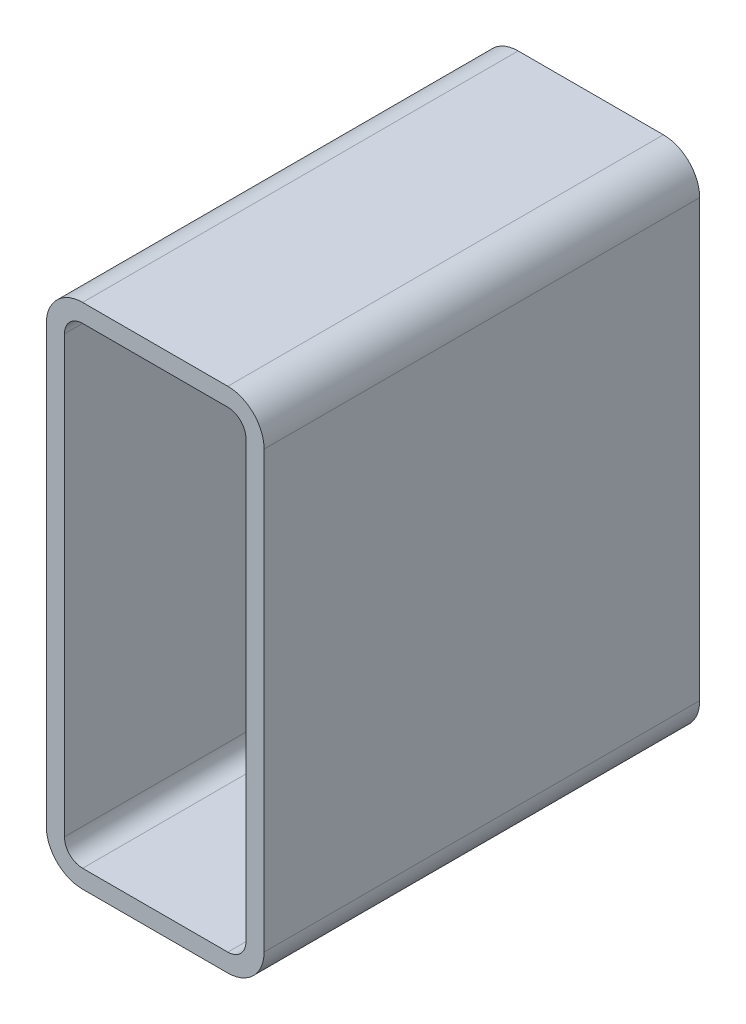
ISO-10303-21;
HEADER;
FILE_DESCRIPTION(('STEP AP214'),'2;1');
FILE_NAME('part.step','',(''),(''),'','','');
FILE_SCHEMA(('AUTOMOTIVE_DESIGN { 1 0 10303 214 1 1 1 1 }'));
ENDSEC;
DATA;
#1=APPLICATION_CONTEXT('core data for automotive mechanical design processes');
#2=APPLICATION_PROTOCOL_DEFINITION('international standard','automotive_design',2000,#1);
#3=PRODUCT_CONTEXT('',#1,'mechanical');
#4=PRODUCT('Part','Part','',(#3));
#5=PRODUCT_RELATED_PRODUCT_CATEGORY('part','',(#4));
#6=PRODUCT_DEFINITION_FORMATION('','',#4);
#7=PRODUCT_DEFINITION_CONTEXT('part definition',#1,'design');
#8=PRODUCT_DEFINITION('design','',#6,#7);
#9=PRODUCT_DEFINITION_SHAPE('','',#8);
#10=(LENGTH_UNIT() NAMED_UNIT(*) SI_UNIT(.MILLI.,.METRE.));
#11=(NAMED_UNIT(*) PLANE_ANGLE_UNIT() SI_UNIT($,.RADIAN.));
#12=(NAMED_UNIT(*) SI_UNIT($,.STERADIAN.) SOLID_ANGLE_UNIT());
#13=UNCERTAINTY_MEASURE_WITH_UNIT(LENGTH_MEASURE(1.E-05),#10,'distance_accuracy_value','');
#14=(GEOMETRIC_REPRESENTATION_CONTEXT(3) GLOBAL_UNCERTAINTY_ASSIGNED_CONTEXT((#13)) GLOBAL_UNIT_ASSIGNED_CONTEXT((#10,
#11,#12)) REPRESENTATION_CONTEXT('',''));
#15=CARTESIAN_POINT('',(0.,0.,0.));
#16=DIRECTION('',(0.,0.,1.));
#17=DIRECTION('',(1.,0.,0.));
#18=AXIS2_PLACEMENT_3D('',#15,#16,#17);
#19=CARTESIAN_POINT('',(25.4473013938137,332.028679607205,304.8));
#20=DIRECTION('',(0.,0.,1.));
#21=DIRECTION('',(1.,0.,0.));
#22=AXIS2_PLACEMENT_3D('',#19,#20,#21);
#23=PLANE('',#22);
#24=CARTESIAN_POINT('',(25.4473013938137,332.028679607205,304.8));
#25=DIRECTION('',(0.,0.,1.));
#26=DIRECTION('',(1.,0.,0.));
#27=AXIS2_PLACEMENT_3D('',#24,#25,#26);
#28=CIRCLE('',#27,25.4);
#29=CARTESIAN_POINT('',(25.4473013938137,357.428679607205,304.8));
#30=VERTEX_POINT('',#29);
#31=CARTESIAN_POINT('',(0.0473013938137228,332.028679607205,304.8));
#32=VERTEX_POINT('',#31);
#33=EDGE_CURVE('E211',#30,#32,#28,.T.);
#34=ORIENTED_EDGE('',*,*,#33,.T.);
#35=DIRECTION('',(0.,-1.,0.));
#36=VECTOR('',#35,1.);
#37=CARTESIAN_POINT('',(0.0473013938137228,27.2286796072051,304.8));
#38=LINE('',#37,#36);
#39=CARTESIAN_POINT('',(0.0473013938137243,27.2286796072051,304.8));
#40=VERTEX_POINT('',#39);
#41=EDGE_CURVE('E214',#32,#40,#38,.T.);
#42=ORIENTED_EDGE('',*,*,#41,.T.);
#43=CARTESIAN_POINT('',(25.4473013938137,27.2286796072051,304.8));
#44=DIRECTION('',(0.,0.,1.));
#45=DIRECTION('',(1.,0.,0.));
#46=AXIS2_PLACEMENT_3D('',#43,#44,#45);
#47=CIRCLE('',#46,25.4);
#48=CARTESIAN_POINT('',(25.4473013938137,1.82867960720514,304.8));
#49=VERTEX_POINT('',#48);
#50=EDGE_CURVE('E217',#40,#49,#47,.T.);
#51=ORIENTED_EDGE('',*,*,#50,.T.);
#52=DIRECTION('',(1.,0.,0.));
#53=VECTOR('',#52,1.);
#54=CARTESIAN_POINT('',(127.047301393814,1.82867960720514,304.8));
#55=LINE('',#54,#53);
#56=CARTESIAN_POINT('',(127.047301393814,1.82867960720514,304.8));
#57=VERTEX_POINT('',#56);
#58=EDGE_CURVE('E219',#49,#57,#55,.T.);
#59=ORIENTED_EDGE('',*,*,#58,.T.);
#60=CARTESIAN_POINT('',(127.047301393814,27.2286796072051,304.8));
#61=DIRECTION('',(0.,0.,1.));
#62=DIRECTION('',(1.,0.,0.));
#63=AXIS2_PLACEMENT_3D('',#60,#61,#62);
#64=CIRCLE('',#63,25.4);
#65=CARTESIAN_POINT('',(152.447301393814,27.2286796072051,304.8));
#66=VERTEX_POINT('',#65);
#67=EDGE_CURVE('E221',#57,#66,#64,.T.);
#68=ORIENTED_EDGE('',*,*,#67,.T.);
#69=DIRECTION('',(0.,1.,0.));
#70=VECTOR('',#69,1.);
#71=CARTESIAN_POINT('',(152.447301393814,332.028679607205,304.8));
#72=LINE('',#71,#70);
#73=CARTESIAN_POINT('',(152.447301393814,332.028679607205,304.8));
#74=VERTEX_POINT('',#73);
#75=EDGE_CURVE('E223',#66,#74,#72,.T.);
#76=ORIENTED_EDGE('',*,*,#75,.T.);
#77=CARTESIAN_POINT('',(127.047301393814,332.028679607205,304.8));
#78=DIRECTION('',(0.,0.,1.));
#79=DIRECTION('',(1.,0.,0.));
#80=AXIS2_PLACEMENT_3D('',#77,#78,#79);
#81=CIRCLE('',#80,25.3999999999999);
#82=CARTESIAN_POINT('',(127.047301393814,357.428679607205,304.8));
#83=VERTEX_POINT('',#82);
#84=EDGE_CURVE('E225',#74,#83,#81,.T.);
#85=ORIENTED_EDGE('',*,*,#84,.T.);
#86=DIRECTION('',(-1.,0.,0.));
#87=VECTOR('',#86,1.);
#88=CARTESIAN_POINT('',(25.4473013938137,357.428679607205,304.8));
#89=LINE('',#88,#87);
#90=EDGE_CURVE('E227',#83,#30,#89,.T.);
#91=ORIENTED_EDGE('',*,*,#90,.T.);
#92=EDGE_LOOP('',(#34,#42,#51,#59,#68,#76,#85,#91));
#93=FACE_BOUND('',#92,.T.);
#94=DIRECTION('',(0.,-1.,0.));
#95=VECTOR('',#94,1.);
#96=CARTESIAN_POINT('',(12.7473013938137,27.2286796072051,304.8));
#97=LINE('',#96,#95);
#98=CARTESIAN_POINT('',(12.7473013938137,332.028679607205,304.8));
#99=VERTEX_POINT('',#98);
#100=CARTESIAN_POINT('',(12.7473013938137,27.2286796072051,304.8));
#101=VERTEX_POINT('',#100);
#102=EDGE_CURVE('E154',#99,#101,#97,.T.);
#103=ORIENTED_EDGE('',*,*,#102,.F.);
#104=CARTESIAN_POINT('',(25.4473013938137,332.028679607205,304.8));
#105=DIRECTION('',(0.,0.,1.));
#106=DIRECTION('',(1.,0.,0.));
#107=AXIS2_PLACEMENT_3D('',#104,#105,#106);
#108=CIRCLE('',#107,12.7);
#109=CARTESIAN_POINT('',(25.4473013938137,344.728679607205,304.8));
#110=VERTEX_POINT('',#109);
#111=EDGE_CURVE('E146',#110,#99,#108,.T.);
#112=ORIENTED_EDGE('',*,*,#111,.F.);
#113=DIRECTION('',(-1.,0.,0.));
#114=VECTOR('',#113,1.);
#115=CARTESIAN_POINT('',(25.4473013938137,344.728679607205,304.8));
#116=LINE('',#115,#114);
#117=CARTESIAN_POINT('',(127.047301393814,344.728679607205,304.8));
#118=VERTEX_POINT('',#117);
#119=EDGE_CURVE('E179',#118,#110,#116,.T.);
#120=ORIENTED_EDGE('',*,*,#119,.F.);
#121=CARTESIAN_POINT('',(127.047301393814,332.028679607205,304.8));
#122=DIRECTION('',(0.,0.,1.));
#123=DIRECTION('',(1.,0.,0.));
#124=AXIS2_PLACEMENT_3D('',#121,#122,#123);
#125=CIRCLE('',#124,12.7);
#126=CARTESIAN_POINT('',(139.747301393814,332.028679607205,304.8));
#127=VERTEX_POINT('',#126);
#128=EDGE_CURVE('E177',#127,#118,#125,.T.);
#129=ORIENTED_EDGE('',*,*,#128,.F.);
#130=DIRECTION('',(0.,1.,0.));
#131=VECTOR('',#130,1.);
#132=CARTESIAN_POINT('',(139.747301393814,332.028679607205,304.8));
#133=LINE('',#132,#131);
#134=CARTESIAN_POINT('',(139.747301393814,27.2286796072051,304.8));
#135=VERTEX_POINT('',#134);
#136=EDGE_CURVE('E175',#135,#127,#133,.T.);
#137=ORIENTED_EDGE('',*,*,#136,.F.);
#138=CARTESIAN_POINT('',(127.047301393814,27.2286796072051,304.8));
#139=DIRECTION('',(0.,0.,1.));
#140=DIRECTION('',(1.,0.,0.));
#141=AXIS2_PLACEMENT_3D('',#138,#139,#140);
#142=CIRCLE('',#141,12.7);
#143=CARTESIAN_POINT('',(127.047301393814,14.5286796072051,304.8));
#144=VERTEX_POINT('',#143);
#145=EDGE_CURVE('E173',#144,#135,#142,.T.);
#146=ORIENTED_EDGE('',*,*,#145,.F.);
#147=DIRECTION('',(1.,0.,0.));
#148=VECTOR('',#147,1.);
#149=CARTESIAN_POINT('',(127.047301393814,14.5286796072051,304.8));
#150=LINE('',#149,#148);
#151=CARTESIAN_POINT('',(25.4473013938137,14.5286796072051,304.8));
#152=VERTEX_POINT('',#151);
#153=EDGE_CURVE('E169',#152,#144,#150,.T.);
#154=ORIENTED_EDGE('',*,*,#153,.F.);
#155=CARTESIAN_POINT('',(25.4473013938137,27.2286796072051,304.8));
#156=DIRECTION('',(0.,0.,1.));
#157=DIRECTION('',(1.,0.,0.));
#158=AXIS2_PLACEMENT_3D('',#155,#156,#157);
#159=CIRCLE('',#158,12.7);
#160=EDGE_CURVE('E167',#101,#152,#159,.T.);
#161=ORIENTED_EDGE('',*,*,#160,.F.);
#162=EDGE_LOOP('',(#103,#112,#120,#129,#137,#146,#154,#161));
#163=FACE_BOUND('',#162,.T.);
#164=ADVANCED_FACE('F33',(#93,#163),#23,.T.);
#165=CARTESIAN_POINT('',(25.4473013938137,332.028679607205,0.));
#166=DIRECTION('',(0.,0.,1.));
#167=DIRECTION('',(1.,0.,0.));
#168=AXIS2_PLACEMENT_3D('',#165,#166,#167);
#169=PLANE('',#168);
#170=CARTESIAN_POINT('',(25.4473013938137,332.028679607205,0.));
#171=DIRECTION('',(0.,0.,1.));
#172=DIRECTION('',(1.,0.,0.));
#173=AXIS2_PLACEMENT_3D('',#170,#171,#172);
#174=CIRCLE('',#173,25.4);
#175=CARTESIAN_POINT('',(25.4473013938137,357.428679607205,0.));
#176=VERTEX_POINT('',#175);
#177=CARTESIAN_POINT('',(0.0473013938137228,332.028679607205,0.));
#178=VERTEX_POINT('',#177);
#179=EDGE_CURVE('E162',#176,#178,#174,.T.);
#180=ORIENTED_EDGE('',*,*,#179,.F.);
#181=DIRECTION('',(-1.,0.,0.));
#182=VECTOR('',#181,1.);
#183=CARTESIAN_POINT('',(25.4473013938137,357.428679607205,0.));
#184=LINE('',#183,#182);
#185=CARTESIAN_POINT('',(127.047301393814,357.428679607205,0.));
#186=VERTEX_POINT('',#185);
#187=EDGE_CURVE('E215',#186,#176,#184,.T.);
#188=ORIENTED_EDGE('',*,*,#187,.F.);
#189=CARTESIAN_POINT('',(127.047301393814,332.028679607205,0.));
#190=DIRECTION('',(0.,0.,1.));
#191=DIRECTION('',(1.,0.,0.));
#192=AXIS2_PLACEMENT_3D('',#189,#190,#191);
#193=CIRCLE('',#192,25.3999999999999);
#194=CARTESIAN_POINT('',(152.447301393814,332.028679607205,0.));
#195=VERTEX_POINT('',#194);
#196=EDGE_CURVE('E242',#195,#186,#193,.T.);
#197=ORIENTED_EDGE('',*,*,#196,.F.);
#198=DIRECTION('',(0.,1.,0.));
#199=VECTOR('',#198,1.);
#200=CARTESIAN_POINT('',(152.447301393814,332.028679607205,0.));
#201=LINE('',#200,#199);
#202=CARTESIAN_POINT('',(152.447301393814,27.2286796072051,0.));
#203=VERTEX_POINT('',#202);
#204=EDGE_CURVE('E240',#203,#195,#201,.T.);
#205=ORIENTED_EDGE('',*,*,#204,.F.);
#206=CARTESIAN_POINT('',(127.047301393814,27.2286796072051,0.));
#207=DIRECTION('',(0.,0.,1.));
#208=DIRECTION('',(1.,0.,0.));
#209=AXIS2_PLACEMENT_3D('',#206,#207,#208);
#210=CIRCLE('',#209,25.4);
#211=CARTESIAN_POINT('',(127.047301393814,1.82867960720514,0.));
#212=VERTEX_POINT('',#211);
#213=EDGE_CURVE('E238',#212,#203,#210,.T.);
#214=ORIENTED_EDGE('',*,*,#213,.F.);
#215=DIRECTION('',(1.,0.,0.));
#216=VECTOR('',#215,1.);
#217=CARTESIAN_POINT('',(127.047301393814,1.82867960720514,0.));
#218=LINE('',#217,#216);
#219=CARTESIAN_POINT('',(25.4473013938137,1.82867960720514,0.));
#220=VERTEX_POINT('',#219);
#221=EDGE_CURVE('E236',#220,#212,#218,.T.);
#222=ORIENTED_EDGE('',*,*,#221,.F.);
#223=CARTESIAN_POINT('',(25.4473013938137,27.2286796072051,0.));
#224=DIRECTION('',(0.,0.,1.));
#225=DIRECTION('',(1.,0.,0.));
#226=AXIS2_PLACEMENT_3D('',#223,#224,#225);
#227=CIRCLE('',#226,25.4);
#228=CARTESIAN_POINT('',(0.0473013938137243,27.2286796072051,0.));
#229=VERTEX_POINT('',#228);
#230=EDGE_CURVE('E234',#229,#220,#227,.T.);
#231=ORIENTED_EDGE('',*,*,#230,.F.);
#232=DIRECTION('',(0.,-1.,0.));
#233=VECTOR('',#232,1.);
#234=CARTESIAN_POINT('',(0.0473013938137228,27.2286796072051,0.));
#235=LINE('',#234,#233);
#236=EDGE_CURVE('E232',#178,#229,#235,.T.);
#237=ORIENTED_EDGE('',*,*,#236,.F.);
#238=EDGE_LOOP('',(#180,#188,#197,#205,#214,#222,#231,#237));
#239=FACE_BOUND('',#238,.T.);
#240=CARTESIAN_POINT('',(25.4473013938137,332.028679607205,0.));
#241=DIRECTION('',(0.,0.,1.));
#242=DIRECTION('',(1.,0.,0.));
#243=AXIS2_PLACEMENT_3D('',#240,#241,#242);
#244=CIRCLE('',#243,12.7);
#245=CARTESIAN_POINT('',(25.4473013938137,344.728679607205,0.));
#246=VERTEX_POINT('',#245);
#247=CARTESIAN_POINT('',(12.7473013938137,332.028679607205,0.));
#248=VERTEX_POINT('',#247);
#249=EDGE_CURVE('E56',#246,#248,#244,.T.);
#250=ORIENTED_EDGE('',*,*,#249,.T.);
#251=DIRECTION('',(0.,-1.,0.));
#252=VECTOR('',#251,1.);
#253=CARTESIAN_POINT('',(12.7473013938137,27.2286796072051,0.));
#254=LINE('',#253,#252);
#255=CARTESIAN_POINT('',(12.7473013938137,27.2286796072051,0.));
#256=VERTEX_POINT('',#255);
#257=EDGE_CURVE('E161',#248,#256,#254,.T.);
#258=ORIENTED_EDGE('',*,*,#257,.T.);
#259=CARTESIAN_POINT('',(25.4473013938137,27.2286796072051,0.));
#260=DIRECTION('',(0.,0.,1.));
#261=DIRECTION('',(1.,0.,0.));
#262=AXIS2_PLACEMENT_3D('',#259,#260,#261);
#263=CIRCLE('',#262,12.7);
#264=CARTESIAN_POINT('',(25.4473013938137,14.5286796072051,0.));
#265=VERTEX_POINT('',#264);
#266=EDGE_CURVE('E183',#256,#265,#263,.T.);
#267=ORIENTED_EDGE('',*,*,#266,.T.);
#268=DIRECTION('',(1.,0.,0.));
#269=VECTOR('',#268,1.);
#270=CARTESIAN_POINT('',(127.047301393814,14.5286796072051,0.));
#271=LINE('',#270,#269);
#272=CARTESIAN_POINT('',(127.047301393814,14.5286796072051,0.));
#273=VERTEX_POINT('',#272);
#274=EDGE_CURVE('E186',#265,#273,#271,.T.);
#275=ORIENTED_EDGE('',*,*,#274,.T.);
#276=CARTESIAN_POINT('',(127.047301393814,27.2286796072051,0.));
#277=DIRECTION('',(0.,0.,1.));
#278=DIRECTION('',(1.,0.,0.));
#279=AXIS2_PLACEMENT_3D('',#276,#277,#278);
#280=CIRCLE('',#279,12.7);
#281=CARTESIAN_POINT('',(139.747301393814,27.2286796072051,0.));
#282=VERTEX_POINT('',#281);
#283=EDGE_CURVE('E189',#273,#282,#280,.T.);
#284=ORIENTED_EDGE('',*,*,#283,.T.);
#285=DIRECTION('',(0.,1.,0.));
#286=VECTOR('',#285,1.);
#287=CARTESIAN_POINT('',(139.747301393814,332.028679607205,0.));
#288=LINE('',#287,#286);
#289=CARTESIAN_POINT('',(139.747301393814,332.028679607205,0.));
#290=VERTEX_POINT('',#289);
#291=EDGE_CURVE('E192',#282,#290,#288,.T.);
#292=ORIENTED_EDGE('',*,*,#291,.T.);
#293=CARTESIAN_POINT('',(127.047301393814,332.028679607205,0.));
#294=DIRECTION('',(0.,0.,1.));
#295=DIRECTION('',(1.,0.,0.));
#296=AXIS2_PLACEMENT_3D('',#293,#294,#295);
#297=CIRCLE('',#296,12.7);
#298=CARTESIAN_POINT('',(127.047301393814,344.728679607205,0.));
#299=VERTEX_POINT('',#298);
#300=EDGE_CURVE('E195',#290,#299,#297,.T.);
#301=ORIENTED_EDGE('',*,*,#300,.T.);
#302=DIRECTION('',(-1.,0.,0.));
#303=VECTOR('',#302,1.);
#304=CARTESIAN_POINT('',(25.4473013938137,344.728679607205,0.));
#305=LINE('',#304,#303);
#306=EDGE_CURVE('E155',#299,#246,#305,.T.);
#307=ORIENTED_EDGE('',*,*,#306,.T.);
#308=EDGE_LOOP('',(#250,#258,#267,#275,#284,#292,#301,#307));
#309=FACE_BOUND('',#308,.T.);
#310=ADVANCED_FACE('F272',(#239,#309),#169,.F.);
#311=CARTESIAN_POINT('',(25.4473013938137,332.028679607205,304.8));
#312=DIRECTION('',(0.,0.,-1.));
#313=DIRECTION('',(-1.,0.,0.));
#314=AXIS2_PLACEMENT_3D('',#311,#312,#313);
#315=CYLINDRICAL_SURFACE('',#314,25.4);
#316=ORIENTED_EDGE('',*,*,#179,.T.);
#317=DIRECTION('',(0.,0.,-1.));
#318=VECTOR('',#317,1.);
#319=CARTESIAN_POINT('',(0.0473013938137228,332.028679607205,304.8));
#320=LINE('',#319,#318);
#321=EDGE_CURVE('E11',#32,#178,#320,.T.);
#322=ORIENTED_EDGE('',*,*,#321,.F.);
#323=ORIENTED_EDGE('',*,*,#33,.F.);
#324=DIRECTION('',(0.,0.,-1.));
#325=VECTOR('',#324,1.);
#326=CARTESIAN_POINT('',(25.4473013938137,357.428679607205,304.8));
#327=LINE('',#326,#325);
#328=EDGE_CURVE('E229',#30,#176,#327,.T.);
#329=ORIENTED_EDGE('',*,*,#328,.T.);
#330=EDGE_LOOP('',(#316,#322,#323,#329));
#331=FACE_BOUND('',#330,.T.);
#332=ADVANCED_FACE('F35',(#331),#315,.T.);
#333=CARTESIAN_POINT('',(0.0473013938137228,27.2286796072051,304.8));
#334=DIRECTION('',(1.,0.,0.));
#335=DIRECTION('',(0.,0.,-1.));
#336=AXIS2_PLACEMENT_3D('',#333,#334,#335);
#337=PLANE('',#336);
#338=ORIENTED_EDGE('',*,*,#236,.T.);
#339=DIRECTION('',(0.,0.,-1.));
#340=VECTOR('',#339,1.);
#341=CARTESIAN_POINT('',(0.0473013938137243,27.2286796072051,304.8));
#342=LINE('',#341,#340);
#343=EDGE_CURVE('E41',#40,#229,#342,.T.);
#344=ORIENTED_EDGE('',*,*,#343,.F.);
#345=ORIENTED_EDGE('',*,*,#41,.F.);
#346=ORIENTED_EDGE('',*,*,#321,.T.);
#347=EDGE_LOOP('',(#338,#344,#345,#346));
#348=FACE_BOUND('',#347,.T.);
#349=ADVANCED_FACE('F289',(#348),#337,.F.);
#350=CARTESIAN_POINT('',(25.4473013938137,27.2286796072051,304.8));
#351=DIRECTION('',(0.,0.,-1.));
#352=DIRECTION('',(-1.,0.,0.));
#353=AXIS2_PLACEMENT_3D('',#350,#351,#352);
#354=CYLINDRICAL_SURFACE('',#353,25.4);
#355=ORIENTED_EDGE('',*,*,#230,.T.);
#356=DIRECTION('',(0.,0.,-1.));
#357=VECTOR('',#356,1.);
#358=CARTESIAN_POINT('',(25.4473013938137,1.82867960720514,304.8));
#359=LINE('',#358,#357);
#360=EDGE_CURVE('E259',#49,#220,#359,.T.);
#361=ORIENTED_EDGE('',*,*,#360,.F.);
#362=ORIENTED_EDGE('',*,*,#50,.F.);
#363=ORIENTED_EDGE('',*,*,#343,.T.);
#364=EDGE_LOOP('',(#355,#361,#362,#363));
#365=FACE_BOUND('',#364,.T.);
#366=ADVANCED_FACE('F266',(#365),#354,.T.);
#367=CARTESIAN_POINT('',(127.047301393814,1.82867960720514,304.8));
#368=DIRECTION('',(0.,1.,0.));
#369=DIRECTION('',(0.,0.,1.));
#370=AXIS2_PLACEMENT_3D('',#367,#368,#369);
#371=PLANE('',#370);
#372=ORIENTED_EDGE('',*,*,#221,.T.);
#373=DIRECTION('',(0.,0.,-1.));
#374=VECTOR('',#373,1.);
#375=CARTESIAN_POINT('',(127.047301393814,1.82867960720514,304.8));
#376=LINE('',#375,#374);
#377=EDGE_CURVE('E256',#57,#212,#376,.T.);
#378=ORIENTED_EDGE('',*,*,#377,.F.);
#379=ORIENTED_EDGE('',*,*,#58,.F.);
#380=ORIENTED_EDGE('',*,*,#360,.T.);
#381=EDGE_LOOP('',(#372,#378,#379,#380));
#382=FACE_BOUND('',#381,.T.);
#383=ADVANCED_FACE('F278',(#382),#371,.F.);
#384=CARTESIAN_POINT('',(127.047301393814,27.2286796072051,304.8));
#385=DIRECTION('',(0.,0.,-1.));
#386=DIRECTION('',(-1.,0.,0.));
#387=AXIS2_PLACEMENT_3D('',#384,#385,#386);
#388=CYLINDRICAL_SURFACE('',#387,25.4);
#389=ORIENTED_EDGE('',*,*,#213,.T.);
#390=DIRECTION('',(0.,0.,-1.));
#391=VECTOR('',#390,1.);
#392=CARTESIAN_POINT('',(152.447301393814,27.2286796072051,304.8));
#393=LINE('',#392,#391);
#394=EDGE_CURVE('E253',#66,#203,#393,.T.);
#395=ORIENTED_EDGE('',*,*,#394,.F.);
#396=ORIENTED_EDGE('',*,*,#67,.F.);
#397=ORIENTED_EDGE('',*,*,#377,.T.);
#398=EDGE_LOOP('',(#389,#395,#396,#397));
#399=FACE_BOUND('',#398,.T.);
#400=ADVANCED_FACE('F282',(#399),#388,.T.);
#401=CARTESIAN_POINT('',(152.447301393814,332.028679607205,304.8));
#402=DIRECTION('',(-1.,0.,0.));
#403=DIRECTION('',(0.,0.,1.));
#404=AXIS2_PLACEMENT_3D('',#401,#402,#403);
#405=PLANE('',#404);
#406=ORIENTED_EDGE('',*,*,#204,.T.);
#407=DIRECTION('',(0.,0.,-1.));
#408=VECTOR('',#407,1.);
#409=CARTESIAN_POINT('',(152.447301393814,332.028679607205,304.8));
#410=LINE('',#409,#408);
#411=EDGE_CURVE('E250',#74,#195,#410,.T.);
#412=ORIENTED_EDGE('',*,*,#411,.F.);
#413=ORIENTED_EDGE('',*,*,#75,.F.);
#414=ORIENTED_EDGE('',*,*,#394,.T.);
#415=EDGE_LOOP('',(#406,#412,#413,#414));
#416=FACE_BOUND('',#415,.T.);
#417=ADVANCED_FACE('F302',(#416),#405,.F.);
#418=CARTESIAN_POINT('',(127.047301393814,332.028679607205,304.8));
#419=DIRECTION('',(0.,0.,-1.));
#420=DIRECTION('',(-1.,0.,0.));
#421=AXIS2_PLACEMENT_3D('',#418,#419,#420);
#422=CYLINDRICAL_SURFACE('',#421,25.3999999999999);
#423=ORIENTED_EDGE('',*,*,#196,.T.);
#424=DIRECTION('',(0.,0.,-1.));
#425=VECTOR('',#424,1.);
#426=CARTESIAN_POINT('',(127.047301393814,357.428679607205,304.8));
#427=LINE('',#426,#425);
#428=EDGE_CURVE('E247',#83,#186,#427,.T.);
#429=ORIENTED_EDGE('',*,*,#428,.F.);
#430=ORIENTED_EDGE('',*,*,#84,.F.);
#431=ORIENTED_EDGE('',*,*,#411,.T.);
#432=EDGE_LOOP('',(#423,#429,#430,#431));
#433=FACE_BOUND('',#432,.T.);
#434=ADVANCED_FACE('F300',(#433),#422,.T.);
#435=CARTESIAN_POINT('',(25.4473013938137,357.428679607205,304.8));
#436=DIRECTION('',(0.,-1.,0.));
#437=DIRECTION('',(0.,0.,-1.));
#438=AXIS2_PLACEMENT_3D('',#435,#436,#437);
#439=PLANE('',#438);
#440=ORIENTED_EDGE('',*,*,#187,.T.);
#441=ORIENTED_EDGE('',*,*,#328,.F.);
#442=ORIENTED_EDGE('',*,*,#90,.F.);
#443=ORIENTED_EDGE('',*,*,#428,.T.);
#444=EDGE_LOOP('',(#440,#441,#442,#443));
#445=FACE_BOUND('',#444,.T.);
#446=ADVANCED_FACE('F295',(#445),#439,.F.);
#447=CARTESIAN_POINT('',(25.4473013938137,332.028679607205,304.8));
#448=DIRECTION('',(0.,0.,-1.));
#449=DIRECTION('',(-1.,0.,0.));
#450=AXIS2_PLACEMENT_3D('',#447,#448,#449);
#451=CYLINDRICAL_SURFACE('',#450,12.7);
#452=ORIENTED_EDGE('',*,*,#249,.F.);
#453=DIRECTION('',(0.,0.,-1.));
#454=VECTOR('',#453,1.);
#455=CARTESIAN_POINT('',(25.4473013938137,344.728679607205,304.8));
#456=LINE('',#455,#454);
#457=EDGE_CURVE('E150',#110,#246,#456,.T.);
#458=ORIENTED_EDGE('',*,*,#457,.F.);
#459=ORIENTED_EDGE('',*,*,#111,.T.);
#460=DIRECTION('',(0.,0.,-1.));
#461=VECTOR('',#460,1.);
#462=CARTESIAN_POINT('',(12.7473013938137,332.028679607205,304.8));
#463=LINE('',#462,#461);
#464=EDGE_CURVE('E149',#99,#248,#463,.T.);
#465=ORIENTED_EDGE('',*,*,#464,.T.);
#466=EDGE_LOOP('',(#452,#458,#459,#465));
#467=FACE_BOUND('',#466,.T.);
#468=ADVANCED_FACE('F148',(#467),#451,.F.);
#469=CARTESIAN_POINT('',(12.7473013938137,27.2286796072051,304.8));
#470=DIRECTION('',(1.,0.,0.));
#471=DIRECTION('',(0.,0.,-1.));
#472=AXIS2_PLACEMENT_3D('',#469,#470,#471);
#473=PLANE('',#472);
#474=ORIENTED_EDGE('',*,*,#257,.F.);
#475=ORIENTED_EDGE('',*,*,#464,.F.);
#476=ORIENTED_EDGE('',*,*,#102,.T.);
#477=DIRECTION('',(0.,0.,-1.));
#478=VECTOR('',#477,1.);
#479=CARTESIAN_POINT('',(12.7473013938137,27.2286796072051,304.8));
#480=LINE('',#479,#478);
#481=EDGE_CURVE('E163',#101,#256,#480,.T.);
#482=ORIENTED_EDGE('',*,*,#481,.T.);
#483=EDGE_LOOP('',(#474,#475,#476,#482));
#484=FACE_BOUND('',#483,.T.);
#485=ADVANCED_FACE('F158',(#484),#473,.T.);
#486=CARTESIAN_POINT('',(25.4473013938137,27.2286796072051,304.8));
#487=DIRECTION('',(0.,0.,-1.));
#488=DIRECTION('',(-1.,0.,0.));
#489=AXIS2_PLACEMENT_3D('',#486,#487,#488);
#490=CYLINDRICAL_SURFACE('',#489,12.7);
#491=ORIENTED_EDGE('',*,*,#266,.F.);
#492=ORIENTED_EDGE('',*,*,#481,.F.);
#493=ORIENTED_EDGE('',*,*,#160,.T.);
#494=DIRECTION('',(0.,0.,-1.));
#495=VECTOR('',#494,1.);
#496=CARTESIAN_POINT('',(25.4473013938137,14.5286796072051,304.8));
#497=LINE('',#496,#495);
#498=EDGE_CURVE('E208',#152,#265,#497,.T.);
#499=ORIENTED_EDGE('',*,*,#498,.T.);
#500=EDGE_LOOP('',(#491,#492,#493,#499));
#501=FACE_BOUND('',#500,.T.);
#502=ADVANCED_FACE('F327',(#501),#490,.F.);
#503=CARTESIAN_POINT('',(127.047301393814,14.5286796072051,304.8));
#504=DIRECTION('',(0.,1.,0.));
#505=DIRECTION('',(0.,0.,1.));
#506=AXIS2_PLACEMENT_3D('',#503,#504,#505);
#507=PLANE('',#506);
#508=ORIENTED_EDGE('',*,*,#274,.F.);
#509=ORIENTED_EDGE('',*,*,#498,.F.);
#510=ORIENTED_EDGE('',*,*,#153,.T.);
#511=DIRECTION('',(0.,0.,-1.));
#512=VECTOR('',#511,1.);
#513=CARTESIAN_POINT('',(127.047301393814,14.5286796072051,304.8));
#514=LINE('',#513,#512);
#515=EDGE_CURVE('E206',#144,#273,#514,.T.);
#516=ORIENTED_EDGE('',*,*,#515,.T.);
#517=EDGE_LOOP('',(#508,#509,#510,#516));
#518=FACE_BOUND('',#517,.T.);
#519=ADVANCED_FACE('F331',(#518),#507,.T.);
#520=CARTESIAN_POINT('',(127.047301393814,27.2286796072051,304.8));
#521=DIRECTION('',(0.,0.,-1.));
#522=DIRECTION('',(-1.,0.,0.));
#523=AXIS2_PLACEMENT_3D('',#520,#521,#522);
#524=CYLINDRICAL_SURFACE('',#523,12.7);
#525=ORIENTED_EDGE('',*,*,#283,.F.);
#526=ORIENTED_EDGE('',*,*,#515,.F.);
#527=ORIENTED_EDGE('',*,*,#145,.T.);
#528=DIRECTION('',(0.,0.,-1.));
#529=VECTOR('',#528,1.);
#530=CARTESIAN_POINT('',(139.747301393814,27.2286796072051,304.8));
#531=LINE('',#530,#529);
#532=EDGE_CURVE('E204',#135,#282,#531,.T.);
#533=ORIENTED_EDGE('',*,*,#532,.T.);
#534=EDGE_LOOP('',(#525,#526,#527,#533));
#535=FACE_BOUND('',#534,.T.);
#536=ADVANCED_FACE('F337',(#535),#524,.F.);
#537=CARTESIAN_POINT('',(139.747301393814,332.028679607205,304.8));
#538=DIRECTION('',(-1.,0.,0.));
#539=DIRECTION('',(0.,0.,1.));
#540=AXIS2_PLACEMENT_3D('',#537,#538,#539);
#541=PLANE('',#540);
#542=ORIENTED_EDGE('',*,*,#291,.F.);
#543=ORIENTED_EDGE('',*,*,#532,.F.);
#544=ORIENTED_EDGE('',*,*,#136,.T.);
#545=DIRECTION('',(0.,0.,-1.));
#546=VECTOR('',#545,1.);
#547=CARTESIAN_POINT('',(139.747301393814,332.028679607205,304.8));
#548=LINE('',#547,#546);
#549=EDGE_CURVE('E202',#127,#290,#548,.T.);
#550=ORIENTED_EDGE('',*,*,#549,.T.);
#551=EDGE_LOOP('',(#542,#543,#544,#550));
#552=FACE_BOUND('',#551,.T.);
#553=ADVANCED_FACE('F341',(#552),#541,.T.);
#554=CARTESIAN_POINT('',(127.047301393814,332.028679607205,304.8));
#555=DIRECTION('',(0.,0.,-1.));
#556=DIRECTION('',(-1.,0.,0.));
#557=AXIS2_PLACEMENT_3D('',#554,#555,#556);
#558=CYLINDRICAL_SURFACE('',#557,12.7);
#559=ORIENTED_EDGE('',*,*,#300,.F.);
#560=ORIENTED_EDGE('',*,*,#549,.F.);
#561=ORIENTED_EDGE('',*,*,#128,.T.);
#562=DIRECTION('',(0.,0.,-1.));
#563=VECTOR('',#562,1.);
#564=CARTESIAN_POINT('',(127.047301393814,344.728679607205,304.8));
#565=LINE('',#564,#563);
#566=EDGE_CURVE('E48',#118,#299,#565,.T.);
#567=ORIENTED_EDGE('',*,*,#566,.T.);
#568=EDGE_LOOP('',(#559,#560,#561,#567));
#569=FACE_BOUND('',#568,.T.);
#570=ADVANCED_FACE('F345',(#569),#558,.F.);
#571=CARTESIAN_POINT('',(25.4473013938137,344.728679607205,304.8));
#572=DIRECTION('',(0.,-1.,0.));
#573=DIRECTION('',(0.,0.,-1.));
#574=AXIS2_PLACEMENT_3D('',#571,#572,#573);
#575=PLANE('',#574);
#576=ORIENTED_EDGE('',*,*,#306,.F.);
#577=ORIENTED_EDGE('',*,*,#566,.F.);
#578=ORIENTED_EDGE('',*,*,#119,.T.);
#579=ORIENTED_EDGE('',*,*,#457,.T.);
#580=EDGE_LOOP('',(#576,#577,#578,#579));
#581=FACE_BOUND('',#580,.T.);
#582=ADVANCED_FACE('F349',(#581),#575,.T.);
#583=CLOSED_SHELL('',(#164,#310,#332,#349,#366,#383,#400,#417,#434,#446,#468,#485,#502,#519,
#536,#553,#570,#582));
#584=MANIFOLD_SOLID_BREP('B2',#583);
#585=ADVANCED_BREP_SHAPE_REPRESENTATION('',(#18,#584),#14);
#586=SHAPE_DEFINITION_REPRESENTATION(#9,#585);
ENDSEC;
END-ISO-10303-21;
